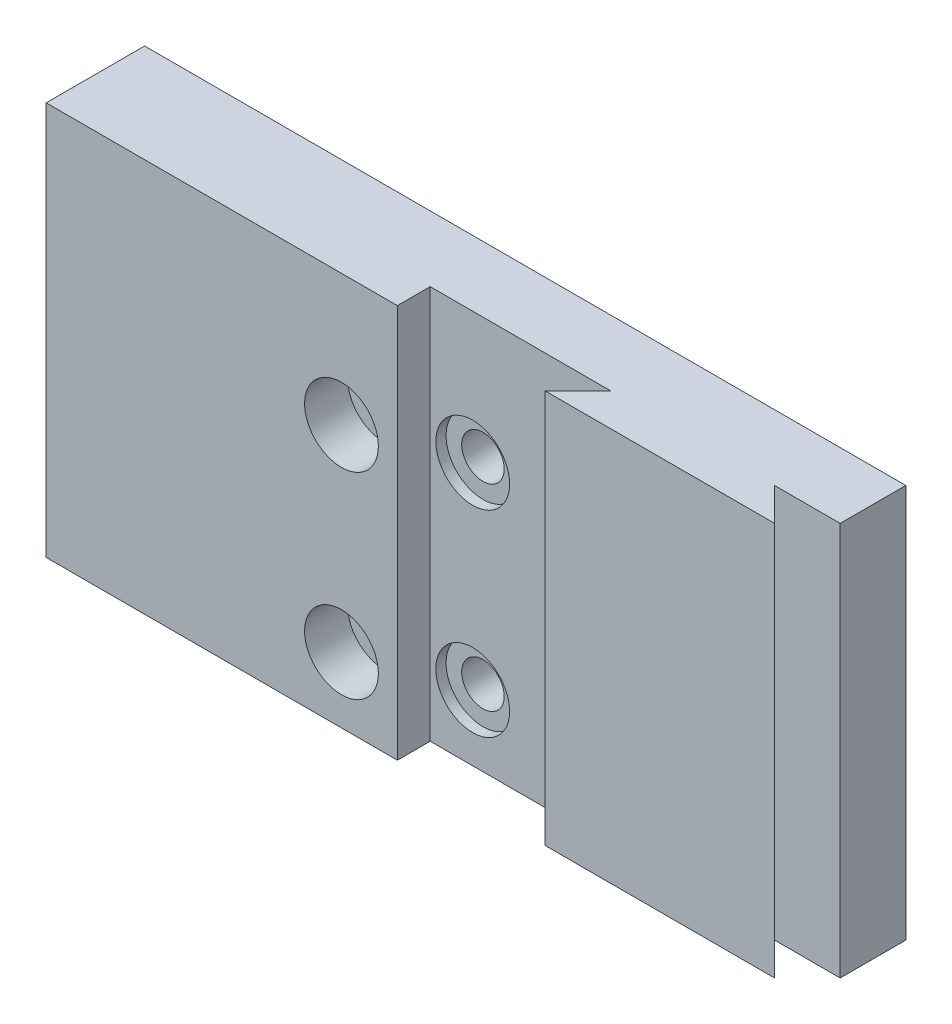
ISO-10303-21;
HEADER;
FILE_DESCRIPTION(('STEP AP214'),'2;1');
FILE_NAME('part.step','',(''),(''),'','','');
FILE_SCHEMA(('AUTOMOTIVE_DESIGN { 1 0 10303 214 1 1 1 1 }'));
ENDSEC;
DATA;
#1=APPLICATION_CONTEXT('core data for automotive mechanical design processes');
#2=APPLICATION_PROTOCOL_DEFINITION('international standard','automotive_design',2000,#1);
#3=PRODUCT_CONTEXT('',#1,'mechanical');
#4=PRODUCT('Part','Part','',(#3));
#5=PRODUCT_RELATED_PRODUCT_CATEGORY('part','',(#4));
#6=PRODUCT_DEFINITION_FORMATION('','',#4);
#7=PRODUCT_DEFINITION_CONTEXT('part definition',#1,'design');
#8=PRODUCT_DEFINITION('design','',#6,#7);
#9=PRODUCT_DEFINITION_SHAPE('','',#8);
#10=(LENGTH_UNIT() NAMED_UNIT(*) SI_UNIT(.MILLI.,.METRE.));
#11=(NAMED_UNIT(*) PLANE_ANGLE_UNIT() SI_UNIT($,.RADIAN.));
#12=(NAMED_UNIT(*) SI_UNIT($,.STERADIAN.) SOLID_ANGLE_UNIT());
#13=UNCERTAINTY_MEASURE_WITH_UNIT(LENGTH_MEASURE(1.E-05),#10,'distance_accuracy_value','');
#14=(GEOMETRIC_REPRESENTATION_CONTEXT(3) GLOBAL_UNCERTAINTY_ASSIGNED_CONTEXT((#13)) GLOBAL_UNIT_ASSIGNED_CONTEXT((#10,
#11,#12)) REPRESENTATION_CONTEXT('',''));
#15=CARTESIAN_POINT('',(0.,0.,0.));
#16=DIRECTION('',(0.,0.,1.));
#17=DIRECTION('',(1.,0.,0.));
#18=AXIS2_PLACEMENT_3D('',#15,#16,#17);
#19=CARTESIAN_POINT('',(0.,0.,9.525));
#20=DIRECTION('',(0.,0.,1.));
#21=DIRECTION('',(1.,0.,0.));
#22=AXIS2_PLACEMENT_3D('',#19,#20,#21);
#23=PLANE('',#22);
#24=DIRECTION('',(0.,-1.,0.));
#25=VECTOR('',#24,1.);
#26=CARTESIAN_POINT('',(70.485,0.,9.525));
#27=LINE('',#26,#25);
#28=CARTESIAN_POINT('',(70.485,38.1,9.525));
#29=VERTEX_POINT('',#28);
#30=CARTESIAN_POINT('',(70.485,0.,9.525));
#31=VERTEX_POINT('',#30);
#32=EDGE_CURVE('E200',#29,#31,#27,.T.);
#33=ORIENTED_EDGE('',*,*,#32,.F.);
#34=DIRECTION('',(-1.,0.,0.));
#35=VECTOR('',#34,1.);
#36=CARTESIAN_POINT('',(73.66,38.1,9.525));
#37=LINE('',#36,#35);
#38=CARTESIAN_POINT('',(48.26,38.1,9.525));
#39=VERTEX_POINT('',#38);
#40=EDGE_CURVE('E177',#29,#39,#37,.T.);
#41=ORIENTED_EDGE('',*,*,#40,.T.);
#42=DIRECTION('',(0.,1.,0.));
#43=VECTOR('',#42,1.);
#44=CARTESIAN_POINT('',(48.26,0.,9.525));
#45=LINE('',#44,#43);
#46=CARTESIAN_POINT('',(48.26,0.,9.525));
#47=VERTEX_POINT('',#46);
#48=EDGE_CURVE('E198',#47,#39,#45,.T.);
#49=ORIENTED_EDGE('',*,*,#48,.F.);
#50=DIRECTION('',(1.,0.,0.));
#51=VECTOR('',#50,1.);
#52=CARTESIAN_POINT('',(0.,0.,9.525));
#53=LINE('',#52,#51);
#54=EDGE_CURVE('E171',#47,#31,#53,.T.);
#55=ORIENTED_EDGE('',*,*,#54,.T.);
#56=EDGE_LOOP('',(#33,#41,#49,#55));
#57=FACE_BOUND('',#56,.T.);
#58=ADVANCED_FACE('F33',(#57),#23,.T.);
#59=CARTESIAN_POINT('',(0.,38.1,9.525));
#60=DIRECTION('',(1.,0.,0.));
#61=DIRECTION('',(0.,0.,-1.));
#62=AXIS2_PLACEMENT_3D('',#59,#60,#61);
#63=PLANE('',#62);
#64=CARTESIAN_POINT('',(0.,25.4,4.7498));
#65=DIRECTION('',(-1.,0.,0.));
#66=DIRECTION('',(0.,0.,1.));
#67=AXIS2_PLACEMENT_3D('',#64,#65,#66);
#68=CIRCLE('',#67,2.0574);
#69=CARTESIAN_POINT('',(0.,25.4,6.8072));
#70=VERTEX_POINT('',#69);
#71=EDGE_CURVE('E155',#70,#70,#68,.T.);
#72=ORIENTED_EDGE('',*,*,#71,.F.);
#73=EDGE_LOOP('',(#72));
#74=FACE_BOUND('',#73,.T.);
#75=CARTESIAN_POINT('',(0.,6.35,4.7498));
#76=DIRECTION('',(-1.,0.,0.));
#77=DIRECTION('',(0.,0.,1.));
#78=AXIS2_PLACEMENT_3D('',#75,#76,#77);
#79=CIRCLE('',#78,2.0574);
#80=CARTESIAN_POINT('',(0.,6.35,6.8072));
#81=VERTEX_POINT('',#80);
#82=EDGE_CURVE('E159',#81,#81,#79,.T.);
#83=ORIENTED_EDGE('',*,*,#82,.F.);
#84=EDGE_LOOP('',(#83));
#85=FACE_BOUND('',#84,.T.);
#86=DIRECTION('',(0.,-1.,0.));
#87=VECTOR('',#86,1.);
#88=CARTESIAN_POINT('',(0.,38.1,0.));
#89=LINE('',#88,#87);
#90=CARTESIAN_POINT('',(0.,38.1,0.));
#91=VERTEX_POINT('',#90);
#92=CARTESIAN_POINT('',(0.,0.,0.));
#93=VERTEX_POINT('',#92);
#94=EDGE_CURVE('E165',#91,#93,#89,.T.);
#95=ORIENTED_EDGE('',*,*,#94,.T.);
#96=DIRECTION('',(0.,0.,-1.));
#97=VECTOR('',#96,1.);
#98=CARTESIAN_POINT('',(0.,0.,9.525));
#99=LINE('',#98,#97);
#100=CARTESIAN_POINT('',(0.,0.,9.525));
#101=VERTEX_POINT('',#100);
#102=EDGE_CURVE('E194',#101,#93,#99,.T.);
#103=ORIENTED_EDGE('',*,*,#102,.F.);
#104=DIRECTION('',(0.,-1.,0.));
#105=VECTOR('',#104,1.);
#106=CARTESIAN_POINT('',(0.,38.1,9.525));
#107=LINE('',#106,#105);
#108=CARTESIAN_POINT('',(0.,38.1,9.525));
#109=VERTEX_POINT('',#108);
#110=EDGE_CURVE('E168',#109,#101,#107,.T.);
#111=ORIENTED_EDGE('',*,*,#110,.F.);
#112=DIRECTION('',(0.,0.,-1.));
#113=VECTOR('',#112,1.);
#114=CARTESIAN_POINT('',(0.,38.1,9.525));
#115=LINE('',#114,#113);
#116=EDGE_CURVE('E187',#109,#91,#115,.T.);
#117=ORIENTED_EDGE('',*,*,#116,.T.);
#118=EDGE_LOOP('',(#95,#103,#111,#117));
#119=FACE_BOUND('',#118,.T.);
#120=ADVANCED_FACE('F35',(#74,#85,#119),#63,.F.);
#121=CARTESIAN_POINT('',(0.,0.,9.525));
#122=DIRECTION('',(0.,1.,0.));
#123=DIRECTION('',(0.,0.,1.));
#124=AXIS2_PLACEMENT_3D('',#121,#122,#123);
#125=PLANE('',#124);
#126=DIRECTION('',(0.,0.,-1.));
#127=VECTOR('',#126,1.);
#128=CARTESIAN_POINT('',(73.66,0.,9.525));
#129=LINE('',#128,#127);
#130=CARTESIAN_POINT('',(73.66,0.,6.35));
#131=VERTEX_POINT('',#130);
#132=CARTESIAN_POINT('',(73.66,0.,0.));
#133=VERTEX_POINT('',#132);
#134=EDGE_CURVE('E192',#131,#133,#129,.T.);
#135=ORIENTED_EDGE('',*,*,#134,.F.);
#136=DIRECTION('',(1.,0.,0.));
#137=VECTOR('',#136,1.);
#138=CARTESIAN_POINT('',(73.66,0.,6.35));
#139=LINE('',#138,#137);
#140=CARTESIAN_POINT('',(67.31,0.,6.35));
#141=VERTEX_POINT('',#140);
#142=EDGE_CURVE('E122',#141,#131,#139,.T.);
#143=ORIENTED_EDGE('',*,*,#142,.F.);
#144=DIRECTION('',(-0.707106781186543,0.,-0.707106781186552));
#145=VECTOR('',#144,1.);
#146=CARTESIAN_POINT('',(67.31,0.,6.35));
#147=LINE('',#146,#145);
#148=EDGE_CURVE('E137',#31,#141,#147,.T.);
#149=ORIENTED_EDGE('',*,*,#148,.F.);
#150=ORIENTED_EDGE('',*,*,#54,.F.);
#151=DIRECTION('',(-0.707106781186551,0.,0.707106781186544));
#152=VECTOR('',#151,1.);
#153=CARTESIAN_POINT('',(48.26,0.,9.525));
#154=LINE('',#153,#152);
#155=CARTESIAN_POINT('',(51.435,0.,6.35));
#156=VERTEX_POINT('',#155);
#157=EDGE_CURVE('E135',#156,#47,#154,.T.);
#158=ORIENTED_EDGE('',*,*,#157,.F.);
#159=DIRECTION('',(1.,0.,0.));
#160=VECTOR('',#159,1.);
#161=CARTESIAN_POINT('',(51.435,0.,6.35));
#162=LINE('',#161,#160);
#163=CARTESIAN_POINT('',(33.9852,0.,6.35));
#164=VERTEX_POINT('',#163);
#165=EDGE_CURVE('E118',#164,#156,#162,.T.);
#166=ORIENTED_EDGE('',*,*,#165,.F.);
#167=DIRECTION('',(0.,0.,-1.));
#168=VECTOR('',#167,1.);
#169=CARTESIAN_POINT('',(33.9852,0.,6.35));
#170=LINE('',#169,#168);
#171=CARTESIAN_POINT('',(33.9852,0.,9.525));
#172=VERTEX_POINT('',#171);
#173=EDGE_CURVE('E125',#172,#164,#170,.T.);
#174=ORIENTED_EDGE('',*,*,#173,.F.);
#175=EDGE_CURVE('E173',#101,#172,#53,.T.);
#176=ORIENTED_EDGE('',*,*,#175,.F.);
#177=ORIENTED_EDGE('',*,*,#102,.T.);
#178=DIRECTION('',(1.,0.,0.));
#179=VECTOR('',#178,1.);
#180=CARTESIAN_POINT('',(0.,0.,0.));
#181=LINE('',#180,#179);
#182=EDGE_CURVE('E180',#93,#133,#181,.T.);
#183=ORIENTED_EDGE('',*,*,#182,.T.);
#184=EDGE_LOOP('',(#135,#143,#149,#150,#158,#166,#174,#176,#177,#183));
#185=FACE_BOUND('',#184,.T.);
#186=ADVANCED_FACE('F133',(#185),#125,.F.);
#187=CARTESIAN_POINT('',(73.66,0.,9.525));
#188=DIRECTION('',(-1.,0.,0.));
#189=DIRECTION('',(0.,0.,1.));
#190=AXIS2_PLACEMENT_3D('',#187,#188,#189);
#191=PLANE('',#190);
#192=DIRECTION('',(0.,0.,-1.));
#193=VECTOR('',#192,1.);
#194=CARTESIAN_POINT('',(73.66,38.1,9.525));
#195=LINE('',#194,#193);
#196=CARTESIAN_POINT('',(73.66,38.1,6.35));
#197=VERTEX_POINT('',#196);
#198=CARTESIAN_POINT('',(73.66,38.1,0.));
#199=VERTEX_POINT('',#198);
#200=EDGE_CURVE('E190',#197,#199,#195,.T.);
#201=ORIENTED_EDGE('',*,*,#200,.F.);
#202=DIRECTION('',(0.,-1.,0.));
#203=VECTOR('',#202,1.);
#204=CARTESIAN_POINT('',(73.66,45.72,6.35));
#205=LINE('',#204,#203);
#206=EDGE_CURVE('E144',#197,#131,#205,.T.);
#207=ORIENTED_EDGE('',*,*,#206,.T.);
#208=ORIENTED_EDGE('',*,*,#134,.T.);
#209=DIRECTION('',(0.,1.,0.));
#210=VECTOR('',#209,1.);
#211=CARTESIAN_POINT('',(73.66,0.,0.));
#212=LINE('',#211,#210);
#213=EDGE_CURVE('E183',#133,#199,#212,.T.);
#214=ORIENTED_EDGE('',*,*,#213,.T.);
#215=EDGE_LOOP('',(#201,#207,#208,#214));
#216=FACE_BOUND('',#215,.T.);
#217=ADVANCED_FACE('F273',(#216),#191,.F.);
#218=CARTESIAN_POINT('',(73.66,38.1,9.525));
#219=DIRECTION('',(0.,-1.,0.));
#220=DIRECTION('',(1.,0.,0.));
#221=AXIS2_PLACEMENT_3D('',#218,#219,#220);
#222=PLANE('',#221);
#223=DIRECTION('',(-0.707106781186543,0.,-0.707106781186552));
#224=VECTOR('',#223,1.);
#225=CARTESIAN_POINT('',(72.0725,38.1,11.1125));
#226=LINE('',#225,#224);
#227=CARTESIAN_POINT('',(67.31,38.1,6.35));
#228=VERTEX_POINT('',#227);
#229=EDGE_CURVE('E58',#29,#228,#226,.T.);
#230=ORIENTED_EDGE('',*,*,#229,.T.);
#231=DIRECTION('',(1.,0.,0.));
#232=VECTOR('',#231,1.);
#233=CARTESIAN_POINT('',(73.66,38.1,6.35));
#234=LINE('',#233,#232);
#235=EDGE_CURVE('E11',#228,#197,#234,.T.);
#236=ORIENTED_EDGE('',*,*,#235,.T.);
#237=ORIENTED_EDGE('',*,*,#200,.T.);
#238=DIRECTION('',(-1.,0.,0.));
#239=VECTOR('',#238,1.);
#240=CARTESIAN_POINT('',(73.66,38.1,0.));
#241=LINE('',#240,#239);
#242=EDGE_CURVE('E172',#199,#91,#241,.T.);
#243=ORIENTED_EDGE('',*,*,#242,.T.);
#244=ORIENTED_EDGE('',*,*,#116,.F.);
#245=CARTESIAN_POINT('',(33.9852,38.1,9.525));
#246=VERTEX_POINT('',#245);
#247=EDGE_CURVE('E175',#246,#109,#37,.T.);
#248=ORIENTED_EDGE('',*,*,#247,.F.);
#249=DIRECTION('',(0.,0.,-1.));
#250=VECTOR('',#249,1.);
#251=CARTESIAN_POINT('',(33.9852,38.1,9.525));
#252=LINE('',#251,#250);
#253=CARTESIAN_POINT('',(33.9852,38.1,6.35));
#254=VERTEX_POINT('',#253);
#255=EDGE_CURVE('E50',#246,#254,#252,.T.);
#256=ORIENTED_EDGE('',*,*,#255,.T.);
#257=DIRECTION('',(1.,0.,0.));
#258=VECTOR('',#257,1.);
#259=CARTESIAN_POINT('',(73.66,38.1,6.35));
#260=LINE('',#259,#258);
#261=CARTESIAN_POINT('',(51.435,38.1,6.35));
#262=VERTEX_POINT('',#261);
#263=EDGE_CURVE('E42',#254,#262,#260,.T.);
#264=ORIENTED_EDGE('',*,*,#263,.T.);
#265=DIRECTION('',(-0.707106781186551,0.,0.707106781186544));
#266=VECTOR('',#265,1.);
#267=CARTESIAN_POINT('',(60.9600000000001,38.1,-3.17499999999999));
#268=LINE('',#267,#266);
#269=EDGE_CURVE('E151',#262,#39,#268,.T.);
#270=ORIENTED_EDGE('',*,*,#269,.T.);
#271=ORIENTED_EDGE('',*,*,#40,.F.);
#272=EDGE_LOOP('',(#230,#236,#237,#243,#244,#248,#256,#264,#270,#271));
#273=FACE_BOUND('',#272,.T.);
#274=ADVANCED_FACE('F256',(#273),#222,.F.);
#275=CARTESIAN_POINT('',(28.575,25.4,9.525));
#276=DIRECTION('',(0.,0.,1.));
#277=DIRECTION('',(1.,0.,0.));
#278=AXIS2_PLACEMENT_3D('',#275,#276,#277);
#279=CIRCLE('',#278,3.5687);
#280=CARTESIAN_POINT('',(32.1437,25.4,9.525));
#281=VERTEX_POINT('',#280);
#282=EDGE_CURVE('E246',#281,#281,#279,.T.);
#283=ORIENTED_EDGE('',*,*,#282,.F.);
#284=EDGE_LOOP('',(#283));
#285=FACE_BOUND('',#284,.T.);
#286=CARTESIAN_POINT('',(28.575,6.35,9.525));
#287=DIRECTION('',(0.,0.,1.));
#288=DIRECTION('',(1.,0.,0.));
#289=AXIS2_PLACEMENT_3D('',#286,#287,#288);
#290=CIRCLE('',#289,3.5687);
#291=CARTESIAN_POINT('',(32.1437,6.35,9.525));
#292=VERTEX_POINT('',#291);
#293=EDGE_CURVE('E234',#292,#292,#290,.T.);
#294=ORIENTED_EDGE('',*,*,#293,.F.);
#295=EDGE_LOOP('',(#294));
#296=FACE_BOUND('',#295,.T.);
#297=DIRECTION('',(0.,-1.,0.));
#298=VECTOR('',#297,1.);
#299=CARTESIAN_POINT('',(33.9852,0.,9.525));
#300=LINE('',#299,#298);
#301=EDGE_CURVE('E127',#246,#172,#300,.T.);
#302=ORIENTED_EDGE('',*,*,#301,.F.);
#303=ORIENTED_EDGE('',*,*,#247,.T.);
#304=ORIENTED_EDGE('',*,*,#110,.T.);
#305=ORIENTED_EDGE('',*,*,#175,.T.);
#306=EDGE_LOOP('',(#302,#303,#304,#305));
#307=FACE_BOUND('',#306,.T.);
#308=ADVANCED_FACE('F252',(#285,#296,#307),#23,.T.);
#309=CARTESIAN_POINT('',(0.,0.,0.));
#310=DIRECTION('',(0.,0.,1.));
#311=DIRECTION('',(1.,0.,0.));
#312=AXIS2_PLACEMENT_3D('',#309,#310,#311);
#313=PLANE('',#312);
#314=CARTESIAN_POINT('',(28.575,25.4,0.));
#315=DIRECTION('',(0.,0.,1.));
#316=DIRECTION('',(1.,0.,0.));
#317=AXIS2_PLACEMENT_3D('',#314,#315,#316);
#318=CIRCLE('',#317,2.0574);
#319=CARTESIAN_POINT('',(30.6324,25.4,0.));
#320=VERTEX_POINT('',#319);
#321=EDGE_CURVE('E237',#320,#320,#318,.T.);
#322=ORIENTED_EDGE('',*,*,#321,.T.);
#323=EDGE_LOOP('',(#322));
#324=FACE_BOUND('',#323,.T.);
#325=CARTESIAN_POINT('',(28.575,6.35,0.));
#326=DIRECTION('',(0.,0.,1.));
#327=DIRECTION('',(1.,0.,0.));
#328=AXIS2_PLACEMENT_3D('',#325,#326,#327);
#329=CIRCLE('',#328,2.0574);
#330=CARTESIAN_POINT('',(30.6324,6.35,0.));
#331=VERTEX_POINT('',#330);
#332=EDGE_CURVE('E225',#331,#331,#329,.T.);
#333=ORIENTED_EDGE('',*,*,#332,.T.);
#334=EDGE_LOOP('',(#333));
#335=FACE_BOUND('',#334,.T.);
#336=CARTESIAN_POINT('',(38.1,25.4,0.));
#337=DIRECTION('',(0.,0.,1.));
#338=DIRECTION('',(1.,0.,0.));
#339=AXIS2_PLACEMENT_3D('',#336,#337,#338);
#340=CIRCLE('',#339,2.0574);
#341=CARTESIAN_POINT('',(40.1574,25.4,0.));
#342=VERTEX_POINT('',#341);
#343=EDGE_CURVE('E216',#342,#342,#340,.T.);
#344=ORIENTED_EDGE('',*,*,#343,.T.);
#345=EDGE_LOOP('',(#344));
#346=FACE_BOUND('',#345,.T.);
#347=CARTESIAN_POINT('',(38.1,6.35,0.));
#348=DIRECTION('',(0.,0.,1.));
#349=DIRECTION('',(1.,0.,0.));
#350=AXIS2_PLACEMENT_3D('',#347,#348,#349);
#351=CIRCLE('',#350,2.0574);
#352=CARTESIAN_POINT('',(40.1574,6.35,0.));
#353=VERTEX_POINT('',#352);
#354=EDGE_CURVE('E203',#353,#353,#351,.T.);
#355=ORIENTED_EDGE('',*,*,#354,.T.);
#356=EDGE_LOOP('',(#355));
#357=FACE_BOUND('',#356,.T.);
#358=ORIENTED_EDGE('',*,*,#94,.F.);
#359=ORIENTED_EDGE('',*,*,#242,.F.);
#360=ORIENTED_EDGE('',*,*,#213,.F.);
#361=ORIENTED_EDGE('',*,*,#182,.F.);
#362=EDGE_LOOP('',(#358,#359,#360,#361));
#363=FACE_BOUND('',#362,.T.);
#364=ADVANCED_FACE('F255',(#324,#335,#346,#357,#363),#313,.F.);
#365=CARTESIAN_POINT('',(15.24,6.35,4.7498));
#366=DIRECTION('',(-1.,0.,0.));
#367=DIRECTION('',(0.,0.,1.));
#368=AXIS2_PLACEMENT_3D('',#365,#366,#367);
#369=CYLINDRICAL_SURFACE('',#368,2.0574);
#370=CARTESIAN_POINT('',(15.24,6.35,4.7498));
#371=DIRECTION('',(-1.,0.,0.));
#372=DIRECTION('',(0.,0.,1.));
#373=AXIS2_PLACEMENT_3D('',#370,#371,#372);
#374=CIRCLE('',#373,2.0574);
#375=CARTESIAN_POINT('',(15.24,6.35,6.8072));
#376=VERTEX_POINT('',#375);
#377=EDGE_CURVE('E162',#376,#376,#374,.T.);
#378=CARTESIAN_POINT('',(15.24,6.35,6.8072));
#379=CARTESIAN_POINT('',(15.08125,6.35,6.8072));
#380=CARTESIAN_POINT('',(14.9225,6.35,6.8072));
#381=CARTESIAN_POINT('',(14.605,6.35,6.8072));
#382=CARTESIAN_POINT('',(14.44625,6.35,6.8072));
#383=CARTESIAN_POINT('',(14.12875,6.35,6.8072));
#384=CARTESIAN_POINT('',(13.97,6.35,6.8072));
#385=CARTESIAN_POINT('',(13.6525,6.35,6.8072));
#386=CARTESIAN_POINT('',(13.49375,6.35,6.8072));
#387=CARTESIAN_POINT('',(13.17625,6.35,6.8072));
#388=CARTESIAN_POINT('',(13.0175,6.35,6.8072));
#389=CARTESIAN_POINT('',(12.7,6.35,6.8072));
#390=CARTESIAN_POINT('',(12.54125,6.35,6.8072));
#391=CARTESIAN_POINT('',(12.22375,6.35,6.8072));
#392=CARTESIAN_POINT('',(12.065,6.35,6.8072));
#393=CARTESIAN_POINT('',(11.7475,6.35,6.8072));
#394=CARTESIAN_POINT('',(11.58875,6.35,6.8072));
#395=CARTESIAN_POINT('',(11.27125,6.35,6.8072));
#396=CARTESIAN_POINT('',(11.1125,6.35,6.8072));
#397=CARTESIAN_POINT('',(10.795,6.35,6.8072));
#398=CARTESIAN_POINT('',(10.63625,6.35,6.8072));
#399=CARTESIAN_POINT('',(10.31875,6.35,6.8072));
#400=CARTESIAN_POINT('',(10.16,6.35,6.8072));
#401=CARTESIAN_POINT('',(9.8425,6.35,6.8072));
#402=CARTESIAN_POINT('',(9.68375,6.35,6.8072));
#403=CARTESIAN_POINT('',(9.36625,6.35,6.8072));
#404=CARTESIAN_POINT('',(9.2075,6.35,6.8072));
#405=CARTESIAN_POINT('',(8.89,6.35,6.8072));
#406=CARTESIAN_POINT('',(8.73125,6.35,6.8072));
#407=CARTESIAN_POINT('',(8.41375,6.35,6.8072));
#408=CARTESIAN_POINT('',(8.255,6.35,6.8072));
#409=CARTESIAN_POINT('',(7.9375,6.35,6.8072));
#410=CARTESIAN_POINT('',(7.77875,6.35,6.8072));
#411=CARTESIAN_POINT('',(7.46125,6.35,6.8072));
#412=CARTESIAN_POINT('',(7.3025,6.35,6.8072));
#413=CARTESIAN_POINT('',(6.985,6.35,6.8072));
#414=CARTESIAN_POINT('',(6.82625,6.35,6.8072));
#415=CARTESIAN_POINT('',(6.50875,6.35,6.8072));
#416=CARTESIAN_POINT('',(6.35,6.35,6.8072));
#417=CARTESIAN_POINT('',(6.0325,6.35,6.8072));
#418=CARTESIAN_POINT('',(5.87375,6.35,6.8072));
#419=CARTESIAN_POINT('',(5.55625,6.35,6.8072));
#420=CARTESIAN_POINT('',(5.3975,6.35,6.8072));
#421=CARTESIAN_POINT('',(5.08,6.35,6.8072));
#422=CARTESIAN_POINT('',(4.92125,6.35,6.8072));
#423=CARTESIAN_POINT('',(4.60375,6.35,6.8072));
#424=CARTESIAN_POINT('',(4.445,6.35,6.8072));
#425=CARTESIAN_POINT('',(4.1275,6.35,6.8072));
#426=CARTESIAN_POINT('',(3.96875,6.35,6.8072));
#427=CARTESIAN_POINT('',(3.65125,6.35,6.8072));
#428=CARTESIAN_POINT('',(3.4925,6.35,6.8072));
#429=CARTESIAN_POINT('',(3.175,6.35,6.8072));
#430=CARTESIAN_POINT('',(3.01625,6.35,6.8072));
#431=CARTESIAN_POINT('',(2.69875,6.35,6.8072));
#432=CARTESIAN_POINT('',(2.54,6.35,6.8072));
#433=CARTESIAN_POINT('',(2.2225,6.35,6.8072));
#434=CARTESIAN_POINT('',(2.06375,6.35,6.8072));
#435=CARTESIAN_POINT('',(1.74625,6.35,6.8072));
#436=CARTESIAN_POINT('',(1.5875,6.35,6.8072));
#437=CARTESIAN_POINT('',(1.27,6.35,6.8072));
#438=CARTESIAN_POINT('',(1.11125,6.35,6.8072));
#439=CARTESIAN_POINT('',(0.79375,6.35,6.8072));
#440=CARTESIAN_POINT('',(0.634999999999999,6.35,6.8072));
#441=CARTESIAN_POINT('',(0.3175,6.35,6.8072));
#442=CARTESIAN_POINT('',(0.15875,6.35,6.8072));
#443=CARTESIAN_POINT('',(0.,6.35,6.8072));
#444=B_SPLINE_CURVE_WITH_KNOTS('',3,(#378,#379,#380,#381,#382,#383,#384,#385,#386,#387,#388,
#389,#390,#391,#392,#393,#394,#395,#396,#397,#398,#399,#400,#401,#402,#403,#404,#405,#406,#407,
#408,#409,#410,#411,#412,#413,#414,#415,#416,#417,#418,#419,#420,#421,#422,#423,#424,#425,#426,
#427,#428,#429,#430,#431,#432,#433,#434,#435,#436,#437,#438,#439,#440,#441,#442,#443),
.UNSPECIFIED.,.F.,.F.,(4,2,2,2,2,2,2,2,2,2,2,2,2,2,2,2,2,2,2,2,2,2,2,2,2,2,2,2,2,2,2,2,4),(0.,
0.476249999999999,0.952499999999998,1.42875,1.905,2.38125,2.8575,3.33375,3.81,4.28625,4.7625,
5.23875,5.715,6.19125,6.6675,7.14375,7.62,8.09625,8.5725,9.04875,9.525,10.00125,10.4775,
10.95375,11.43,11.90625,12.3825,12.85875,13.335,13.81125,14.2875,14.76375,15.24),.UNSPECIFIED.);
#445=EDGE_CURVE('BSEAM304',#376,#81,#444,.T.);
#446=ORIENTED_EDGE('',*,*,#377,.F.);
#447=ORIENTED_EDGE('',*,*,#82,.T.);
#448=ORIENTED_EDGE('',*,*,#445,.T.);
#449=ORIENTED_EDGE('',*,*,#445,.F.);
#450=EDGE_LOOP('',(#446,#448,#447,#449));
#451=FACE_BOUND('',#450,.T.);
#452=ADVANCED_FACE('F304',(#451),#369,.F.);
#453=CARTESIAN_POINT('',(15.24,6.35,4.7498));
#454=DIRECTION('',(-1.,0.,0.));
#455=DIRECTION('',(0.,0.,1.));
#456=AXIS2_PLACEMENT_3D('',#453,#454,#455);
#457=PLANE('',#456);
#458=ORIENTED_EDGE('',*,*,#377,.T.);
#459=EDGE_LOOP('',(#458));
#460=FACE_BOUND('',#459,.T.);
#461=ADVANCED_FACE('F518',(#460),#457,.T.);
#462=CARTESIAN_POINT('',(15.24,25.4,4.7498));
#463=DIRECTION('',(-1.,0.,0.));
#464=DIRECTION('',(0.,0.,1.));
#465=AXIS2_PLACEMENT_3D('',#462,#463,#464);
#466=CYLINDRICAL_SURFACE('',#465,2.0574);
#467=CARTESIAN_POINT('',(15.24,25.4,4.7498));
#468=DIRECTION('',(-1.,0.,0.));
#469=DIRECTION('',(0.,0.,1.));
#470=AXIS2_PLACEMENT_3D('',#467,#468,#469);
#471=CIRCLE('',#470,2.0574);
#472=CARTESIAN_POINT('',(15.24,25.4,6.8072));
#473=VERTEX_POINT('',#472);
#474=EDGE_CURVE('E156',#473,#473,#471,.T.);
#475=CARTESIAN_POINT('',(15.24,25.4,6.8072));
#476=CARTESIAN_POINT('',(15.08125,25.4,6.8072));
#477=CARTESIAN_POINT('',(14.9225,25.4,6.8072));
#478=CARTESIAN_POINT('',(14.605,25.4,6.8072));
#479=CARTESIAN_POINT('',(14.44625,25.4,6.8072));
#480=CARTESIAN_POINT('',(14.12875,25.4,6.8072));
#481=CARTESIAN_POINT('',(13.97,25.4,6.8072));
#482=CARTESIAN_POINT('',(13.6525,25.4,6.8072));
#483=CARTESIAN_POINT('',(13.49375,25.4,6.8072));
#484=CARTESIAN_POINT('',(13.17625,25.4,6.8072));
#485=CARTESIAN_POINT('',(13.0175,25.4,6.8072));
#486=CARTESIAN_POINT('',(12.7,25.4,6.8072));
#487=CARTESIAN_POINT('',(12.54125,25.4,6.8072));
#488=CARTESIAN_POINT('',(12.22375,25.4,6.8072));
#489=CARTESIAN_POINT('',(12.065,25.4,6.8072));
#490=CARTESIAN_POINT('',(11.7475,25.4,6.8072));
#491=CARTESIAN_POINT('',(11.58875,25.4,6.8072));
#492=CARTESIAN_POINT('',(11.27125,25.4,6.8072));
#493=CARTESIAN_POINT('',(11.1125,25.4,6.8072));
#494=CARTESIAN_POINT('',(10.795,25.4,6.8072));
#495=CARTESIAN_POINT('',(10.63625,25.4,6.8072));
#496=CARTESIAN_POINT('',(10.31875,25.4,6.8072));
#497=CARTESIAN_POINT('',(10.16,25.4,6.8072));
#498=CARTESIAN_POINT('',(9.8425,25.4,6.8072));
#499=CARTESIAN_POINT('',(9.68375,25.4,6.8072));
#500=CARTESIAN_POINT('',(9.36625,25.4,6.8072));
#501=CARTESIAN_POINT('',(9.2075,25.4,6.8072));
#502=CARTESIAN_POINT('',(8.89,25.4,6.8072));
#503=CARTESIAN_POINT('',(8.73125,25.4,6.8072));
#504=CARTESIAN_POINT('',(8.41375,25.4,6.8072));
#505=CARTESIAN_POINT('',(8.255,25.4,6.8072));
#506=CARTESIAN_POINT('',(7.9375,25.4,6.8072));
#507=CARTESIAN_POINT('',(7.77875,25.4,6.8072));
#508=CARTESIAN_POINT('',(7.46125,25.4,6.8072));
#509=CARTESIAN_POINT('',(7.3025,25.4,6.8072));
#510=CARTESIAN_POINT('',(6.985,25.4,6.8072));
#511=CARTESIAN_POINT('',(6.82625,25.4,6.8072));
#512=CARTESIAN_POINT('',(6.50875,25.4,6.8072));
#513=CARTESIAN_POINT('',(6.35,25.4,6.8072));
#514=CARTESIAN_POINT('',(6.0325,25.4,6.8072));
#515=CARTESIAN_POINT('',(5.87375,25.4,6.8072));
#516=CARTESIAN_POINT('',(5.55625,25.4,6.8072));
#517=CARTESIAN_POINT('',(5.3975,25.4,6.8072));
#518=CARTESIAN_POINT('',(5.08,25.4,6.8072));
#519=CARTESIAN_POINT('',(4.92125,25.4,6.8072));
#520=CARTESIAN_POINT('',(4.60375,25.4,6.8072));
#521=CARTESIAN_POINT('',(4.445,25.4,6.8072));
#522=CARTESIAN_POINT('',(4.1275,25.4,6.8072));
#523=CARTESIAN_POINT('',(3.96875,25.4,6.8072));
#524=CARTESIAN_POINT('',(3.65125,25.4,6.8072));
#525=CARTESIAN_POINT('',(3.4925,25.4,6.8072));
#526=CARTESIAN_POINT('',(3.175,25.4,6.8072));
#527=CARTESIAN_POINT('',(3.01625,25.4,6.8072));
#528=CARTESIAN_POINT('',(2.69875,25.4,6.8072));
#529=CARTESIAN_POINT('',(2.54,25.4,6.8072));
#530=CARTESIAN_POINT('',(2.2225,25.4,6.8072));
#531=CARTESIAN_POINT('',(2.06375,25.4,6.8072));
#532=CARTESIAN_POINT('',(1.74625,25.4,6.8072));
#533=CARTESIAN_POINT('',(1.5875,25.4,6.8072));
#534=CARTESIAN_POINT('',(1.27,25.4,6.8072));
#535=CARTESIAN_POINT('',(1.11125,25.4,6.8072));
#536=CARTESIAN_POINT('',(0.79375,25.4,6.8072));
#537=CARTESIAN_POINT('',(0.634999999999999,25.4,6.8072));
#538=CARTESIAN_POINT('',(0.3175,25.4,6.8072));
#539=CARTESIAN_POINT('',(0.15875,25.4,6.8072));
#540=CARTESIAN_POINT('',(0.,25.4,6.8072));
#541=B_SPLINE_CURVE_WITH_KNOTS('',3,(#475,#476,#477,#478,#479,#480,#481,#482,#483,#484,#485,
#486,#487,#488,#489,#490,#491,#492,#493,#494,#495,#496,#497,#498,#499,#500,#501,#502,#503,#504,
#505,#506,#507,#508,#509,#510,#511,#512,#513,#514,#515,#516,#517,#518,#519,#520,#521,#522,#523,
#524,#525,#526,#527,#528,#529,#530,#531,#532,#533,#534,#535,#536,#537,#538,#539,#540),
.UNSPECIFIED.,.F.,.F.,(4,2,2,2,2,2,2,2,2,2,2,2,2,2,2,2,2,2,2,2,2,2,2,2,2,2,2,2,2,2,2,2,4),(0.,
0.476249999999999,0.952499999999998,1.42875,1.905,2.38125,2.8575,3.33375,3.81,4.28625,4.7625,
5.23875,5.715,6.19125,6.6675,7.14375,7.62,8.09625,8.5725,9.04875,9.525,10.00125,10.4775,
10.95375,11.43,11.90625,12.3825,12.85875,13.335,13.81125,14.2875,14.76375,15.24),.UNSPECIFIED.);
#542=EDGE_CURVE('BSEAM515',#473,#70,#541,.T.);
#543=ORIENTED_EDGE('',*,*,#474,.F.);
#544=ORIENTED_EDGE('',*,*,#71,.T.);
#545=ORIENTED_EDGE('',*,*,#542,.T.);
#546=ORIENTED_EDGE('',*,*,#542,.F.);
#547=EDGE_LOOP('',(#543,#545,#544,#546));
#548=FACE_BOUND('',#547,.T.);
#549=ADVANCED_FACE('F515',(#548),#466,.F.);
#550=CARTESIAN_POINT('',(15.24,25.4,4.7498));
#551=DIRECTION('',(-1.,0.,0.));
#552=DIRECTION('',(0.,0.,1.));
#553=AXIS2_PLACEMENT_3D('',#550,#551,#552);
#554=PLANE('',#553);
#555=ORIENTED_EDGE('',*,*,#474,.T.);
#556=EDGE_LOOP('',(#555));
#557=FACE_BOUND('',#556,.T.);
#558=ADVANCED_FACE('F331',(#557),#554,.T.);
#559=CARTESIAN_POINT('',(48.26,45.72,9.525));
#560=DIRECTION('',(0.707106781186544,0.,0.707106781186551));
#561=DIRECTION('',(0.707106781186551,0.,-0.707106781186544));
#562=AXIS2_PLACEMENT_3D('',#559,#560,#561);
#563=PLANE('',#562);
#564=DIRECTION('',(0.,-1.,0.));
#565=VECTOR('',#564,1.);
#566=CARTESIAN_POINT('',(51.435,45.72,6.35));
#567=LINE('',#566,#565);
#568=EDGE_CURVE('E121',#262,#156,#567,.T.);
#569=ORIENTED_EDGE('',*,*,#568,.T.);
#570=ORIENTED_EDGE('',*,*,#157,.T.);
#571=ORIENTED_EDGE('',*,*,#48,.T.);
#572=ORIENTED_EDGE('',*,*,#269,.F.);
#573=EDGE_LOOP('',(#569,#570,#571,#572));
#574=FACE_BOUND('',#573,.T.);
#575=ADVANCED_FACE('F326',(#574),#563,.F.);
#576=CARTESIAN_POINT('',(33.9852,45.72,6.35));
#577=DIRECTION('',(-1.,0.,0.));
#578=DIRECTION('',(0.,0.,1.));
#579=AXIS2_PLACEMENT_3D('',#576,#577,#578);
#580=PLANE('',#579);
#581=ORIENTED_EDGE('',*,*,#301,.T.);
#582=ORIENTED_EDGE('',*,*,#173,.T.);
#583=DIRECTION('',(0.,-1.,0.));
#584=VECTOR('',#583,1.);
#585=CARTESIAN_POINT('',(33.9852,45.72,6.35));
#586=LINE('',#585,#584);
#587=EDGE_CURVE('E113',#254,#164,#586,.T.);
#588=ORIENTED_EDGE('',*,*,#587,.F.);
#589=ORIENTED_EDGE('',*,*,#255,.F.);
#590=EDGE_LOOP('',(#581,#582,#588,#589));
#591=FACE_BOUND('',#590,.T.);
#592=ADVANCED_FACE('F126',(#591),#580,.F.);
#593=CARTESIAN_POINT('',(51.435,45.72,6.35));
#594=DIRECTION('',(0.,0.,-1.));
#595=DIRECTION('',(-1.,0.,0.));
#596=AXIS2_PLACEMENT_3D('',#593,#594,#595);
#597=PLANE('',#596);
#598=CARTESIAN_POINT('',(38.1,25.4,6.35));
#599=DIRECTION('',(0.,0.,-1.));
#600=DIRECTION('',(-1.,0.,0.));
#601=AXIS2_PLACEMENT_3D('',#598,#599,#600);
#602=CIRCLE('',#601,3.5687);
#603=CARTESIAN_POINT('',(34.5313,25.4,6.35));
#604=VERTEX_POINT('',#603);
#605=EDGE_CURVE('E37',#604,#604,#602,.T.);
#606=ORIENTED_EDGE('',*,*,#605,.T.);
#607=EDGE_LOOP('',(#606));
#608=FACE_BOUND('',#607,.T.);
#609=CARTESIAN_POINT('',(38.1,6.35,6.35));
#610=DIRECTION('',(0.,0.,-1.));
#611=DIRECTION('',(-1.,0.,0.));
#612=AXIS2_PLACEMENT_3D('',#609,#610,#611);
#613=CIRCLE('',#612,3.5687);
#614=CARTESIAN_POINT('',(34.5313,6.35,6.35));
#615=VERTEX_POINT('',#614);
#616=EDGE_CURVE('E130',#615,#615,#613,.T.);
#617=ORIENTED_EDGE('',*,*,#616,.T.);
#618=EDGE_LOOP('',(#617));
#619=FACE_BOUND('',#618,.T.);
#620=ORIENTED_EDGE('',*,*,#587,.T.);
#621=ORIENTED_EDGE('',*,*,#165,.T.);
#622=ORIENTED_EDGE('',*,*,#568,.F.);
#623=ORIENTED_EDGE('',*,*,#263,.F.);
#624=EDGE_LOOP('',(#620,#621,#622,#623));
#625=FACE_BOUND('',#624,.T.);
#626=ADVANCED_FACE('F115',(#608,#619,#625),#597,.F.);
#627=CARTESIAN_POINT('',(73.66,45.72,6.35));
#628=DIRECTION('',(0.,0.,-1.));
#629=DIRECTION('',(-1.,0.,0.));
#630=AXIS2_PLACEMENT_3D('',#627,#628,#629);
#631=PLANE('',#630);
#632=DIRECTION('',(0.,-1.,0.));
#633=VECTOR('',#632,1.);
#634=CARTESIAN_POINT('',(67.31,45.72,6.35));
#635=LINE('',#634,#633);
#636=EDGE_CURVE('E147',#228,#141,#635,.T.);
#637=ORIENTED_EDGE('',*,*,#636,.T.);
#638=ORIENTED_EDGE('',*,*,#142,.T.);
#639=ORIENTED_EDGE('',*,*,#206,.F.);
#640=ORIENTED_EDGE('',*,*,#235,.F.);
#641=EDGE_LOOP('',(#637,#638,#639,#640));
#642=FACE_BOUND('',#641,.T.);
#643=ADVANCED_FACE('F275',(#642),#631,.F.);
#644=CARTESIAN_POINT('',(67.31,45.72,6.35));
#645=DIRECTION('',(-0.707106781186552,0.,0.707106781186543));
#646=DIRECTION('',(0.707106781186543,0.,0.707106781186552));
#647=AXIS2_PLACEMENT_3D('',#644,#645,#646);
#648=PLANE('',#647);
#649=ORIENTED_EDGE('',*,*,#32,.T.);
#650=ORIENTED_EDGE('',*,*,#148,.T.);
#651=ORIENTED_EDGE('',*,*,#636,.F.);
#652=ORIENTED_EDGE('',*,*,#229,.F.);
#653=EDGE_LOOP('',(#649,#650,#651,#652));
#654=FACE_BOUND('',#653,.T.);
#655=ADVANCED_FACE('F282',(#654),#648,.F.);
#656=CARTESIAN_POINT('',(38.1,6.35,9.525));
#657=DIRECTION('',(0.,0.,1.));
#658=DIRECTION('',(1.,0.,0.));
#659=AXIS2_PLACEMENT_3D('',#656,#657,#658);
#660=CYLINDRICAL_SURFACE('',#659,3.5687);
#661=CARTESIAN_POINT('',(38.1,6.35,5.3594));
#662=DIRECTION('',(0.,0.,1.));
#663=DIRECTION('',(1.,0.,0.));
#664=AXIS2_PLACEMENT_3D('',#661,#662,#663);
#665=CIRCLE('',#664,3.5687);
#666=CARTESIAN_POINT('',(41.6687,6.35,5.3594));
#667=VERTEX_POINT('',#666);
#668=EDGE_CURVE('E211',#667,#667,#665,.T.);
#669=ORIENTED_EDGE('',*,*,#668,.F.);
#670=EDGE_LOOP('',(#669));
#671=FACE_BOUND('',#670,.T.);
#672=ORIENTED_EDGE('',*,*,#616,.F.);
#673=EDGE_LOOP('',(#672));
#674=FACE_BOUND('',#673,.T.);
#675=ADVANCED_FACE('F284',(#671,#674),#660,.F.);
#676=CARTESIAN_POINT('',(38.1,6.35,9.525));
#677=DIRECTION('',(0.,0.,1.));
#678=DIRECTION('',(1.,0.,0.));
#679=AXIS2_PLACEMENT_3D('',#676,#677,#678);
#680=CYLINDRICAL_SURFACE('',#679,2.0574);
#681=ORIENTED_EDGE('',*,*,#354,.F.);
#682=EDGE_LOOP('',(#681));
#683=FACE_BOUND('',#682,.T.);
#684=CARTESIAN_POINT('',(38.1,6.35,5.3594));
#685=DIRECTION('',(0.,0.,1.));
#686=DIRECTION('',(1.,0.,0.));
#687=AXIS2_PLACEMENT_3D('',#684,#685,#686);
#688=CIRCLE('',#687,2.0574);
#689=CARTESIAN_POINT('',(40.1574,6.35,5.3594));
#690=VERTEX_POINT('',#689);
#691=EDGE_CURVE('E207',#690,#690,#688,.T.);
#692=ORIENTED_EDGE('',*,*,#691,.T.);
#693=EDGE_LOOP('',(#692));
#694=FACE_BOUND('',#693,.T.);
#695=ADVANCED_FACE('F290',(#683,#694),#680,.F.);
#696=CARTESIAN_POINT('',(40.1574,6.35,5.3594));
#697=DIRECTION('',(0.,0.,-1.));
#698=DIRECTION('',(-1.,0.,0.));
#699=AXIS2_PLACEMENT_3D('',#696,#697,#698);
#700=PLANE('',#699);
#701=ORIENTED_EDGE('',*,*,#691,.F.);
#702=EDGE_LOOP('',(#701));
#703=FACE_BOUND('',#702,.T.);
#704=ORIENTED_EDGE('',*,*,#668,.T.);
#705=EDGE_LOOP('',(#704));
#706=FACE_BOUND('',#705,.T.);
#707=ADVANCED_FACE('F381',(#703,#706),#700,.F.);
#708=CARTESIAN_POINT('',(38.1,25.4,9.525));
#709=DIRECTION('',(0.,0.,1.));
#710=DIRECTION('',(1.,0.,0.));
#711=AXIS2_PLACEMENT_3D('',#708,#709,#710);
#712=CYLINDRICAL_SURFACE('',#711,3.5687);
#713=CARTESIAN_POINT('',(38.1,25.4,5.3594));
#714=DIRECTION('',(0.,0.,1.));
#715=DIRECTION('',(1.,0.,0.));
#716=AXIS2_PLACEMENT_3D('',#713,#714,#715);
#717=CIRCLE('',#716,3.5687);
#718=CARTESIAN_POINT('',(41.6687,25.4,5.3594));
#719=VERTEX_POINT('',#718);
#720=EDGE_CURVE('E222',#719,#719,#717,.T.);
#721=ORIENTED_EDGE('',*,*,#720,.F.);
#722=EDGE_LOOP('',(#721));
#723=FACE_BOUND('',#722,.T.);
#724=ORIENTED_EDGE('',*,*,#605,.F.);
#725=EDGE_LOOP('',(#724));
#726=FACE_BOUND('',#725,.T.);
#727=ADVANCED_FACE('F391',(#723,#726),#712,.F.);
#728=CARTESIAN_POINT('',(38.1,25.4,9.525));
#729=DIRECTION('',(0.,0.,1.));
#730=DIRECTION('',(1.,0.,0.));
#731=AXIS2_PLACEMENT_3D('',#728,#729,#730);
#732=CYLINDRICAL_SURFACE('',#731,2.0574);
#733=ORIENTED_EDGE('',*,*,#343,.F.);
#734=EDGE_LOOP('',(#733));
#735=FACE_BOUND('',#734,.T.);
#736=CARTESIAN_POINT('',(38.1,25.4,5.3594));
#737=DIRECTION('',(0.,0.,1.));
#738=DIRECTION('',(1.,0.,0.));
#739=AXIS2_PLACEMENT_3D('',#736,#737,#738);
#740=CIRCLE('',#739,2.0574);
#741=CARTESIAN_POINT('',(40.1574,25.4,5.3594));
#742=VERTEX_POINT('',#741);
#743=EDGE_CURVE('E219',#742,#742,#740,.T.);
#744=ORIENTED_EDGE('',*,*,#743,.T.);
#745=EDGE_LOOP('',(#744));
#746=FACE_BOUND('',#745,.T.);
#747=ADVANCED_FACE('F401',(#735,#746),#732,.F.);
#748=CARTESIAN_POINT('',(40.1574,25.4,5.3594));
#749=DIRECTION('',(0.,0.,-1.));
#750=DIRECTION('',(-1.,0.,0.));
#751=AXIS2_PLACEMENT_3D('',#748,#749,#750);
#752=PLANE('',#751);
#753=ORIENTED_EDGE('',*,*,#743,.F.);
#754=EDGE_LOOP('',(#753));
#755=FACE_BOUND('',#754,.T.);
#756=ORIENTED_EDGE('',*,*,#720,.T.);
#757=EDGE_LOOP('',(#756));
#758=FACE_BOUND('',#757,.T.);
#759=ADVANCED_FACE('F411',(#755,#758),#752,.F.);
#760=CARTESIAN_POINT('',(28.575,6.35,9.525));
#761=DIRECTION('',(0.,0.,1.));
#762=DIRECTION('',(1.,0.,0.));
#763=AXIS2_PLACEMENT_3D('',#760,#761,#762);
#764=CYLINDRICAL_SURFACE('',#763,2.0574);
#765=ORIENTED_EDGE('',*,*,#332,.F.);
#766=EDGE_LOOP('',(#765));
#767=FACE_BOUND('',#766,.T.);
#768=CARTESIAN_POINT('',(28.575,6.35,5.3594));
#769=DIRECTION('',(0.,0.,1.));
#770=DIRECTION('',(1.,0.,0.));
#771=AXIS2_PLACEMENT_3D('',#768,#769,#770);
#772=CIRCLE('',#771,2.0574);
#773=CARTESIAN_POINT('',(30.6324,6.35,5.3594));
#774=VERTEX_POINT('',#773);
#775=EDGE_CURVE('E228',#774,#774,#772,.T.);
#776=ORIENTED_EDGE('',*,*,#775,.T.);
#777=EDGE_LOOP('',(#776));
#778=FACE_BOUND('',#777,.T.);
#779=ADVANCED_FACE('F421',(#767,#778),#764,.F.);
#780=CARTESIAN_POINT('',(30.6324,6.35,5.3594));
#781=DIRECTION('',(0.,0.,-1.));
#782=DIRECTION('',(-1.,0.,0.));
#783=AXIS2_PLACEMENT_3D('',#780,#781,#782);
#784=PLANE('',#783);
#785=ORIENTED_EDGE('',*,*,#775,.F.);
#786=EDGE_LOOP('',(#785));
#787=FACE_BOUND('',#786,.T.);
#788=CARTESIAN_POINT('',(28.575,6.35,5.3594));
#789=DIRECTION('',(0.,0.,1.));
#790=DIRECTION('',(1.,0.,0.));
#791=AXIS2_PLACEMENT_3D('',#788,#789,#790);
#792=CIRCLE('',#791,3.5687);
#793=CARTESIAN_POINT('',(32.1437,6.35,5.3594));
#794=VERTEX_POINT('',#793);
#795=EDGE_CURVE('E231',#794,#794,#792,.T.);
#796=ORIENTED_EDGE('',*,*,#795,.T.);
#797=EDGE_LOOP('',(#796));
#798=FACE_BOUND('',#797,.T.);
#799=ADVANCED_FACE('F431',(#787,#798),#784,.F.);
#800=CARTESIAN_POINT('',(28.575,6.35,9.525));
#801=DIRECTION('',(0.,0.,1.));
#802=DIRECTION('',(1.,0.,0.));
#803=AXIS2_PLACEMENT_3D('',#800,#801,#802);
#804=CYLINDRICAL_SURFACE('',#803,3.5687);
#805=ORIENTED_EDGE('',*,*,#795,.F.);
#806=EDGE_LOOP('',(#805));
#807=FACE_BOUND('',#806,.T.);
#808=ORIENTED_EDGE('',*,*,#293,.T.);
#809=EDGE_LOOP('',(#808));
#810=FACE_BOUND('',#809,.T.);
#811=ADVANCED_FACE('F441',(#807,#810),#804,.F.);
#812=CARTESIAN_POINT('',(28.575,25.4,9.525));
#813=DIRECTION('',(0.,0.,1.));
#814=DIRECTION('',(1.,0.,0.));
#815=AXIS2_PLACEMENT_3D('',#812,#813,#814);
#816=CYLINDRICAL_SURFACE('',#815,2.0574);
#817=ORIENTED_EDGE('',*,*,#321,.F.);
#818=EDGE_LOOP('',(#817));
#819=FACE_BOUND('',#818,.T.);
#820=CARTESIAN_POINT('',(28.575,25.4,5.3594));
#821=DIRECTION('',(0.,0.,1.));
#822=DIRECTION('',(1.,0.,0.));
#823=AXIS2_PLACEMENT_3D('',#820,#821,#822);
#824=CIRCLE('',#823,2.0574);
#825=CARTESIAN_POINT('',(30.6324,25.4,5.3594));
#826=VERTEX_POINT('',#825);
#827=EDGE_CURVE('E240',#826,#826,#824,.T.);
#828=ORIENTED_EDGE('',*,*,#827,.T.);
#829=EDGE_LOOP('',(#828));
#830=FACE_BOUND('',#829,.T.);
#831=ADVANCED_FACE('F451',(#819,#830),#816,.F.);
#832=CARTESIAN_POINT('',(30.6324,25.4,5.3594));
#833=DIRECTION('',(0.,0.,-1.));
#834=DIRECTION('',(-1.,0.,0.));
#835=AXIS2_PLACEMENT_3D('',#832,#833,#834);
#836=PLANE('',#835);
#837=ORIENTED_EDGE('',*,*,#827,.F.);
#838=EDGE_LOOP('',(#837));
#839=FACE_BOUND('',#838,.T.);
#840=CARTESIAN_POINT('',(28.575,25.4,5.3594));
#841=DIRECTION('',(0.,0.,1.));
#842=DIRECTION('',(1.,0.,0.));
#843=AXIS2_PLACEMENT_3D('',#840,#841,#842);
#844=CIRCLE('',#843,3.5687);
#845=CARTESIAN_POINT('',(32.1437,25.4,5.3594));
#846=VERTEX_POINT('',#845);
#847=EDGE_CURVE('E243',#846,#846,#844,.T.);
#848=ORIENTED_EDGE('',*,*,#847,.T.);
#849=EDGE_LOOP('',(#848));
#850=FACE_BOUND('',#849,.T.);
#851=ADVANCED_FACE('F461',(#839,#850),#836,.F.);
#852=CARTESIAN_POINT('',(28.575,25.4,9.525));
#853=DIRECTION('',(0.,0.,1.));
#854=DIRECTION('',(1.,0.,0.));
#855=AXIS2_PLACEMENT_3D('',#852,#853,#854);
#856=CYLINDRICAL_SURFACE('',#855,3.5687);
#857=ORIENTED_EDGE('',*,*,#847,.F.);
#858=EDGE_LOOP('',(#857));
#859=FACE_BOUND('',#858,.T.);
#860=ORIENTED_EDGE('',*,*,#282,.T.);
#861=EDGE_LOOP('',(#860));
#862=FACE_BOUND('',#861,.T.);
#863=ADVANCED_FACE('F250',(#859,#862),#856,.F.);
#864=CLOSED_SHELL('',(#58,#120,#186,#217,#274,#308,#364,#452,#461,#549,#558,#575,#592,#626,#643,
#655,#675,#695,#707,#727,#747,#759,#779,#799,#811,#831,#851,#863));
#865=MANIFOLD_SOLID_BREP('B2',#864);
#866=ADVANCED_BREP_SHAPE_REPRESENTATION('',(#18,#865),#14);
#867=SHAPE_DEFINITION_REPRESENTATION(#9,#866);
ENDSEC;
END-ISO-10303-21;
